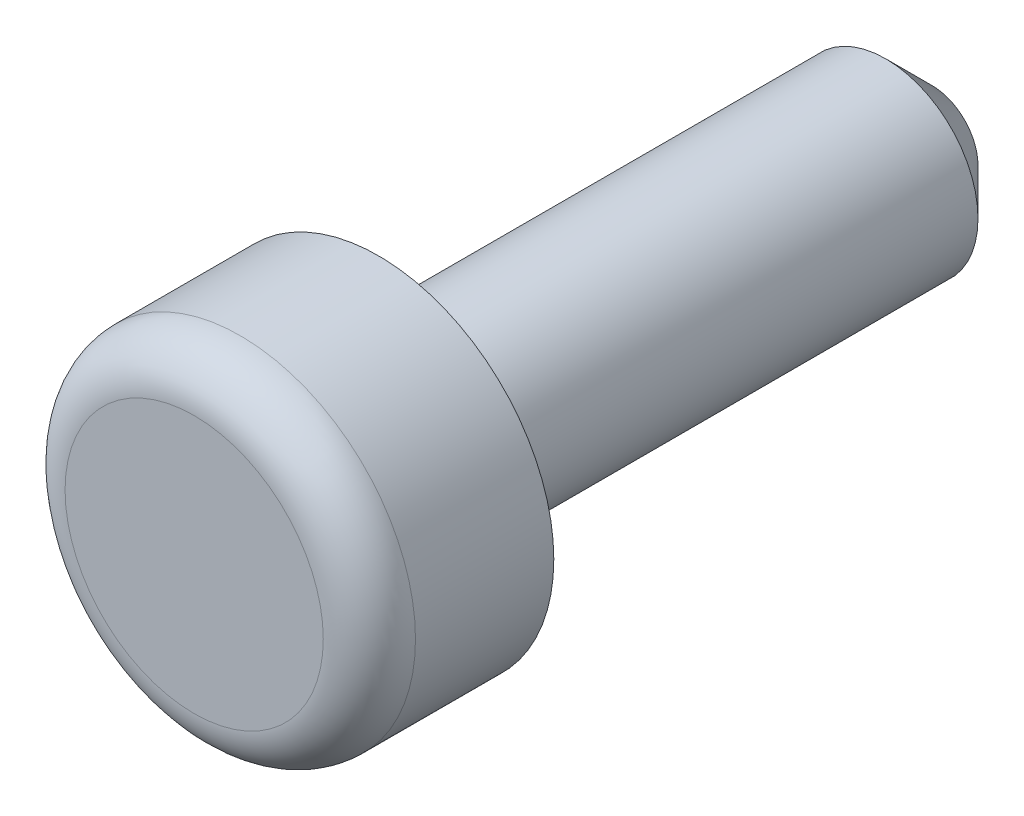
ISO-10303-21;
HEADER;
FILE_DESCRIPTION(('STEP AP214'),'2;1');
FILE_NAME('part.step','',(''),(''),'','','');
FILE_SCHEMA(('AUTOMOTIVE_DESIGN { 1 0 10303 214 1 1 1 1 }'));
ENDSEC;
DATA;
#1=APPLICATION_CONTEXT('core data for automotive mechanical design processes');
#2=APPLICATION_PROTOCOL_DEFINITION('international standard','automotive_design',2000,#1);
#3=PRODUCT_CONTEXT('',#1,'mechanical');
#4=PRODUCT('Part','Part','',(#3));
#5=PRODUCT_RELATED_PRODUCT_CATEGORY('part','',(#4));
#6=PRODUCT_DEFINITION_FORMATION('','',#4);
#7=PRODUCT_DEFINITION_CONTEXT('part definition',#1,'design');
#8=PRODUCT_DEFINITION('design','',#6,#7);
#9=PRODUCT_DEFINITION_SHAPE('','',#8);
#10=(LENGTH_UNIT() NAMED_UNIT(*) SI_UNIT(.MILLI.,.METRE.));
#11=(NAMED_UNIT(*) PLANE_ANGLE_UNIT() SI_UNIT($,.RADIAN.));
#12=(NAMED_UNIT(*) SI_UNIT($,.STERADIAN.) SOLID_ANGLE_UNIT());
#13=UNCERTAINTY_MEASURE_WITH_UNIT(LENGTH_MEASURE(1.E-05),#10,'distance_accuracy_value','');
#14=(GEOMETRIC_REPRESENTATION_CONTEXT(3) GLOBAL_UNCERTAINTY_ASSIGNED_CONTEXT((#13)) GLOBAL_UNIT_ASSIGNED_CONTEXT((#10,
#11,#12)) REPRESENTATION_CONTEXT('',''));
#15=CARTESIAN_POINT('',(0.,0.,0.));
#16=DIRECTION('',(0.,0.,1.));
#17=DIRECTION('',(1.,0.,0.));
#18=AXIS2_PLACEMENT_3D('',#15,#16,#17);
#19=CARTESIAN_POINT('',(0.,0.,2.));
#20=DIRECTION('',(0.,0.,1.));
#21=DIRECTION('',(1.,0.,0.));
#22=AXIS2_PLACEMENT_3D('',#19,#20,#21);
#23=PLANE('',#22);
#24=CARTESIAN_POINT('',(0.,0.,2.));
#25=DIRECTION('',(0.,0.,-1.));
#26=DIRECTION('',(1.,0.,0.));
#27=AXIS2_PLACEMENT_3D('',#24,#25,#26);
#28=CIRCLE('',#27,1.4);
#29=CARTESIAN_POINT('',(1.4,0.,2.));
#30=VERTEX_POINT('',#29);
#31=CARTESIAN_POINT('',(-1.4,0.,2.));
#32=VERTEX_POINT('',#31);
#33=EDGE_CURVE('E37',#30,#32,#28,.T.);
#34=ORIENTED_EDGE('',*,*,#33,.F.);
#35=CARTESIAN_POINT('',(0.,0.,2.));
#36=DIRECTION('',(0.,0.,-1.));
#37=DIRECTION('',(-1.,0.,0.));
#38=AXIS2_PLACEMENT_3D('',#35,#36,#37);
#39=CIRCLE('',#38,1.4);
#40=EDGE_CURVE('E33',#32,#30,#39,.T.);
#41=ORIENTED_EDGE('',*,*,#40,.F.);
#42=EDGE_LOOP('',(#34,#41));
#43=FACE_BOUND('',#42,.T.);
#44=ADVANCED_FACE('F16',(#43),#23,.T.);
#45=CARTESIAN_POINT('',(0.,0.,1.5));
#46=DIRECTION('',(0.,0.,1.));
#47=DIRECTION('',(1.,0.,0.));
#48=AXIS2_PLACEMENT_3D('',#45,#46,#47);
#49=TOROIDAL_SURFACE('',#48,1.4,0.5);
#50=CARTESIAN_POINT('',(0.,0.,1.5));
#51=DIRECTION('',(0.,0.,1.));
#52=DIRECTION('',(1.,0.,0.));
#53=AXIS2_PLACEMENT_3D('',#50,#51,#52);
#54=CIRCLE('',#53,1.9);
#55=CARTESIAN_POINT('',(1.9,0.,1.5));
#56=VERTEX_POINT('',#55);
#57=EDGE_CURVE('E43',#56,#56,#54,.F.);
#58=ORIENTED_EDGE('',*,*,#57,.F.);
#59=EDGE_LOOP('',(#58));
#60=FACE_BOUND('',#59,.T.);
#61=ORIENTED_EDGE('',*,*,#33,.T.);
#62=ORIENTED_EDGE('',*,*,#40,.T.);
#63=EDGE_LOOP('',(#61,#62));
#64=FACE_BOUND('',#63,.T.);
#65=ADVANCED_FACE('F42',(#60,#64),#49,.T.);
#66=CARTESIAN_POINT('',(0.,0.,-6.));
#67=DIRECTION('',(0.,0.,-1.));
#68=DIRECTION('',(-1.,0.,0.));
#69=AXIS2_PLACEMENT_3D('',#66,#67,#68);
#70=PLANE('',#69);
#71=CARTESIAN_POINT('',(0.,0.,-5.99999999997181));
#72=DIRECTION('',(0.,0.,1.));
#73=DIRECTION('',(1.,0.,0.));
#74=AXIS2_PLACEMENT_3D('',#71,#72,#73);
#75=CIRCLE('',#74,0.499999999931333);
#76=CARTESIAN_POINT('',(0.499999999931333,0.,-5.99999999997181));
#77=VERTEX_POINT('',#76);
#78=EDGE_CURVE('E74',#77,#77,#75,.T.);
#79=ORIENTED_EDGE('',*,*,#78,.F.);
#80=EDGE_LOOP('',(#79));
#81=FACE_BOUND('',#80,.T.);
#82=ADVANCED_FACE('F59',(#81),#70,.T.);
#83=CARTESIAN_POINT('',(0.,0.,0.));
#84=DIRECTION('',(0.,0.,1.));
#85=DIRECTION('',(1.,0.,0.));
#86=AXIS2_PLACEMENT_3D('',#83,#84,#85);
#87=CYLINDRICAL_SURFACE('',#86,1.9);
#88=ORIENTED_EDGE('',*,*,#57,.T.);
#89=EDGE_LOOP('',(#88));
#90=FACE_BOUND('',#89,.T.);
#91=CARTESIAN_POINT('',(0.,0.,0.));
#92=DIRECTION('',(0.,0.,1.));
#93=DIRECTION('',(1.,0.,0.));
#94=AXIS2_PLACEMENT_3D('',#91,#92,#93);
#95=CIRCLE('',#94,1.9);
#96=CARTESIAN_POINT('',(1.9,0.,0.));
#97=VERTEX_POINT('',#96);
#98=EDGE_CURVE('E76',#97,#97,#95,.T.);
#99=ORIENTED_EDGE('',*,*,#98,.T.);
#100=EDGE_LOOP('',(#99));
#101=FACE_BOUND('',#100,.T.);
#102=ADVANCED_FACE('F89',(#90,#101),#87,.T.);
#103=CARTESIAN_POINT('',(0.,0.,-5.50000000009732));
#104=DIRECTION('',(0.,0.,1.));
#105=DIRECTION('',(1.,0.,0.));
#106=AXIS2_PLACEMENT_3D('',#103,#104,#105);
#107=CONICAL_SURFACE('',#106,0.999999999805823,0.785398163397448);
#108=CARTESIAN_POINT('',(0.,0.,-5.5));
#109=DIRECTION('',(0.,0.,-1.));
#110=DIRECTION('',(-1.,0.,0.));
#111=AXIS2_PLACEMENT_3D('',#108,#109,#110);
#112=CIRCLE('',#111,1.);
#113=CARTESIAN_POINT('',(-1.,0.,-5.5));
#114=VERTEX_POINT('',#113);
#115=EDGE_CURVE('E27',#114,#114,#112,.F.);
#116=ORIENTED_EDGE('',*,*,#115,.F.);
#117=EDGE_LOOP('',(#116));
#118=FACE_BOUND('',#117,.T.);
#119=ORIENTED_EDGE('',*,*,#78,.T.);
#120=EDGE_LOOP('',(#119));
#121=FACE_BOUND('',#120,.T.);
#122=ADVANCED_FACE('F86',(#118,#121),#107,.T.);
#123=CARTESIAN_POINT('',(0.,0.,0.));
#124=DIRECTION('',(0.,0.,1.));
#125=DIRECTION('',(1.,0.,0.));
#126=AXIS2_PLACEMENT_3D('',#123,#124,#125);
#127=PLANE('',#126);
#128=CARTESIAN_POINT('',(0.,0.,0.));
#129=DIRECTION('',(0.,0.,-1.));
#130=DIRECTION('',(-1.,0.,0.));
#131=AXIS2_PLACEMENT_3D('',#128,#129,#130);
#132=CIRCLE('',#131,1.);
#133=CARTESIAN_POINT('',(-1.,0.,0.));
#134=VERTEX_POINT('',#133);
#135=EDGE_CURVE('E11',#134,#134,#132,.T.);
#136=ORIENTED_EDGE('',*,*,#135,.F.);
#137=EDGE_LOOP('',(#136));
#138=FACE_BOUND('',#137,.T.);
#139=ORIENTED_EDGE('',*,*,#98,.F.);
#140=EDGE_LOOP('',(#139));
#141=FACE_BOUND('',#140,.T.);
#142=ADVANCED_FACE('F97',(#138,#141),#127,.F.);
#143=CARTESIAN_POINT('',(0.,0.,0.));
#144=DIRECTION('',(0.,0.,-1.));
#145=DIRECTION('',(-1.,0.,0.));
#146=AXIS2_PLACEMENT_3D('',#143,#144,#145);
#147=CYLINDRICAL_SURFACE('',#146,1.);
#148=ORIENTED_EDGE('',*,*,#115,.T.);
#149=EDGE_LOOP('',(#148));
#150=FACE_BOUND('',#149,.T.);
#151=ORIENTED_EDGE('',*,*,#135,.T.);
#152=EDGE_LOOP('',(#151));
#153=FACE_BOUND('',#152,.T.);
#154=ADVANCED_FACE('F95',(#150,#153),#147,.T.);
#155=CLOSED_SHELL('',(#44,#65,#82,#102,#122,#142,#154));
#156=MANIFOLD_SOLID_BREP('B1',#155);
#157=ADVANCED_BREP_SHAPE_REPRESENTATION('',(#18,#156),#14);
#158=SHAPE_DEFINITION_REPRESENTATION(#9,#157);
ENDSEC;
END-ISO-10303-21;
